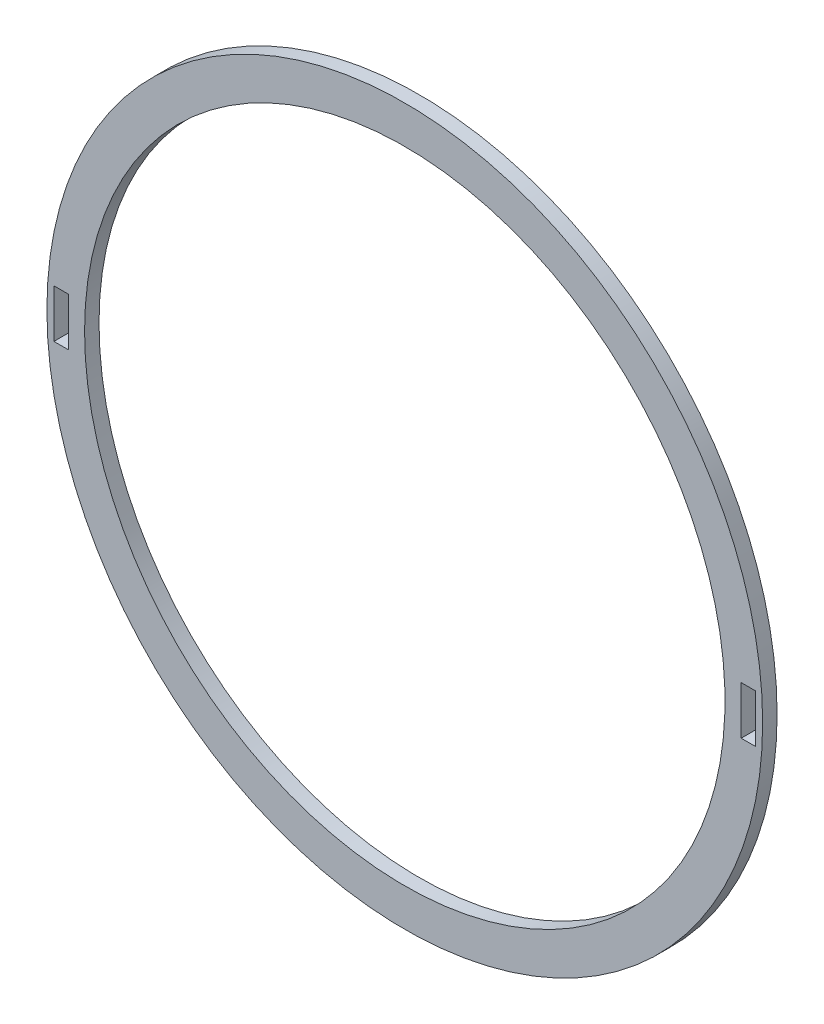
from build123d import *

# Parameters (mm, degrees)
SKETCH1_R           = 37.749892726
SKETCH1_R_2         = 33.776867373
SKETCH1_W           = 1.524
SKETCH1_H           = 5.08
BOSS_EXTRUDE1_DEPTH = 1.524


with BuildPart() as part:
    # Sketch1 → Boss-Extrude1 (new body)
    with BuildSketch(Plane.XY):
        with Locations(Location((0, 25.14119341, 0), (0, 0, 180))):
            Circle(SKETCH1_R)
        with Locations(Location((0, 25.14119341, 0), (0, 0, 180))):
            Circle(SKETCH1_R_2, mode=Mode.SUBTRACT)
        with Locations((36.247543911, 25.14119341)):
            Rectangle(SKETCH1_W, SKETCH1_H, mode=Mode.SUBTRACT)
        with Locations((-36.247543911, 25.14119341)):
            Rectangle(SKETCH1_W, SKETCH1_H, mode=Mode.SUBTRACT)
    extrude(amount=BOSS_EXTRUDE1_DEPTH)


solid = part.part
